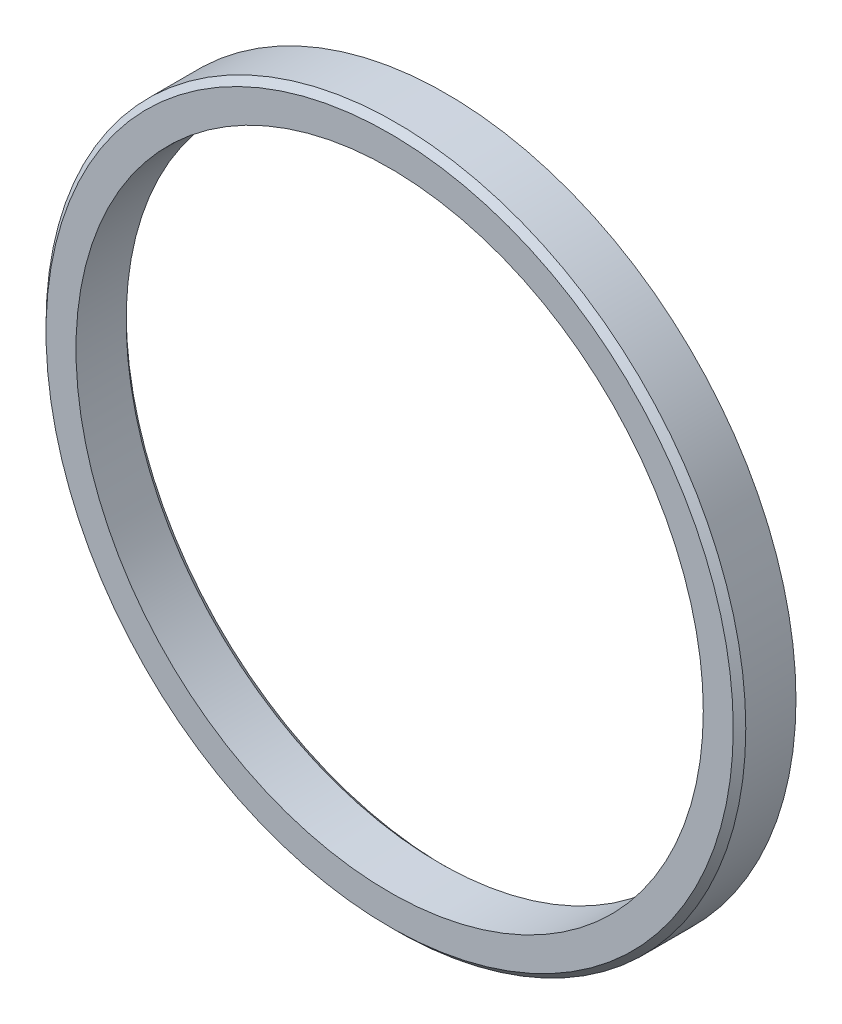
from build123d import *


with BuildPart() as part:
    # Sketch1 → Revolve1 (revolve)
    with BuildSketch(Plane(origin=(0, 0, 0), x_dir=(0, 0, -1), z_dir=(1, 0, 0)), mode=Mode.PRIVATE) as revolve1_sk:
        Polygon((-8, 100), (8, 100), (10, 102), (10, 111.55), (-6, 111.55), (-8, 109.55), align=None)
    revolve(revolve1_sk.sketch.rotate(Axis((0, 0, 66.622749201), (0, 0, -1)), 90), axis=Axis((0, 0, 66.622749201), (0, 0, -1)))


solid = part.part
